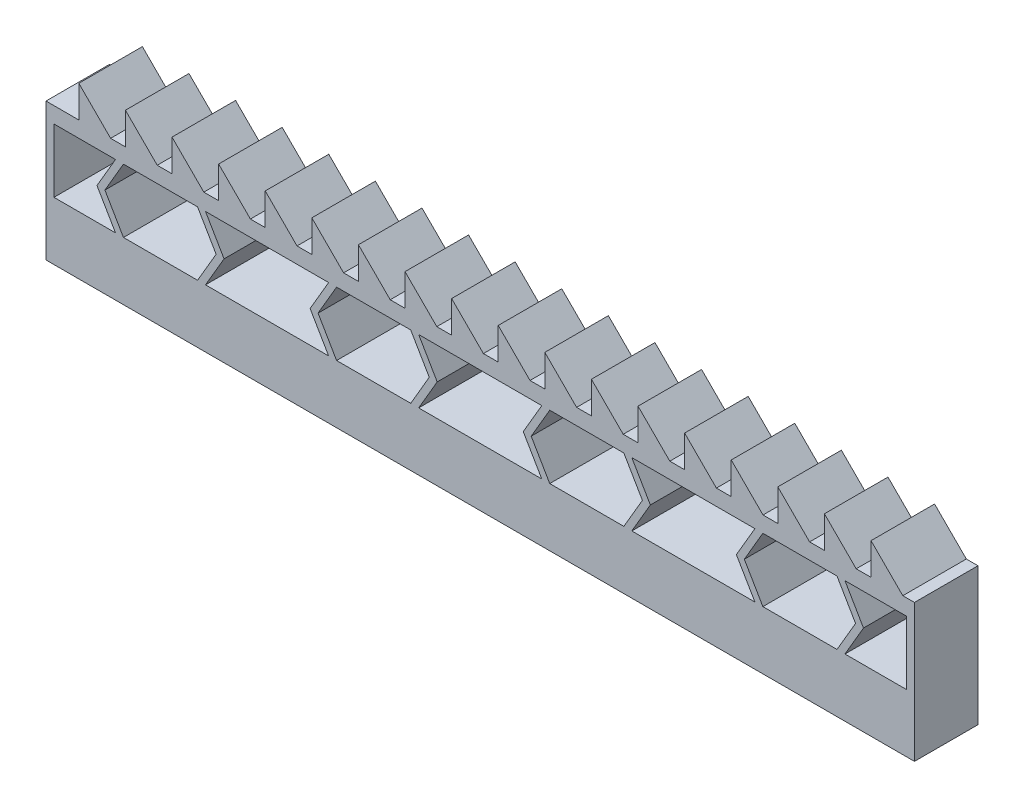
from build123d import *

# Parameters (mm, degrees)
SKETCH1_W           = 82
SKETCH1_H           = 6
BOSS_EXTRUDE1_DEPTH = 13
CUT_EXTRUDE1_DEPTH  = 84.240615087
SKETCH4_W           = 1.4
SKETCH4_H           = 4.8
BOSS_EXTRUDE2_DEPTH = 1.9
SKETCH5_W           = 2.9
SKETCH5_H           = 2
BOSS_EXTRUDE3_DEPTH = 2.1
BOSS_EXTRUDE5_DEPTH = 6
LPATTERN2_COUNT     = 18
LPATTERN2_PITCH     = 4.4
CUT_EXTRUDE2_DEPTH  = 6
LPATTERN3_COUNT     = 4
LPATTERN3_PITCH     = 20.125
FILLET1_R           = 0.5


with BuildPart() as part:
    # Sketch1 → Boss-Extrude1 (new body)
    with BuildSketch(Plane(origin=(0, 0, 0), x_dir=(1, 0, 0), z_dir=(0, 1, 0))):
        with Locations((41, 3)):
            Rectangle(SKETCH1_W, SKETCH1_H)
    extrude(amount=BOSS_EXTRUDE1_DEPTH)

    # Sketch3 → Cut-Extrude1 (cut, through all)
    with BuildSketch(Plane.ZY):
        Polygon((-4, 0), (-2, 0), (-2, 1.8), (-0.6, 1.8), (-0.6, 3.7), (-5.4, 3.7), (-5.4, 1.8), (-4, 1.8), align=None)
    extrude(amount=-CUT_EXTRUDE1_DEPTH, mode=Mode.SUBTRACT)

    # Sketch4 → Boss-Extrude2 (add)
    with BuildSketch(Plane.XZ.offset(-3.7)):
        with Locations((0.7, -3)):
            Rectangle(SKETCH4_W, SKETCH4_H)
        with Locations((81.3, -3)):
            Rectangle(SKETCH4_W, SKETCH4_H)
    extrude(amount=BOSS_EXTRUDE2_DEPTH)

    # Sketch5 → Boss-Extrude3 (add)
    with BuildSketch(Plane.XZ):
        with Locations((80.55, -3)):
            Rectangle(SKETCH5_W, SKETCH5_H)
        with Locations((1.45, -3)):
            Rectangle(SKETCH5_W, SKETCH5_H)
    extrude(amount=-BOSS_EXTRUDE3_DEPTH)

    # Sketch7 → Boss-Extrude5 (add)
    with BuildSketch(Plane.XY):
        Polygon((3.1, 13), (3.1, 16), (6.1, 13), align=None)
    boss_extrude5 = extrude(amount=-BOSS_EXTRUDE5_DEPTH)

    # LPattern2: Boss-Extrude5 ×18
    with Locations(*[(i * LPATTERN2_PITCH, 0, 0) for i in range(1, LPATTERN2_COUNT)]):
        add(boss_extrude5)

    # Sketch6 → Cut-Extrude2 (cut)
    with BuildSketch(Plane.XY):
        Polygon((6.5625, 5.5), (4.8125, 8.5), (6.5625, 11.5), (0.75, 11.5), (0.75, 5.5), align=None)
        Polygon((16.0625, 8.5), (14.3125, 11.5), (7.3125, 11.5), (5.5625, 8.5), (7.3125, 5.5), (14.3125, 5.5), align=None)
        Polygon((20.875, 11.5), (20.875, 5.5), (15.0625, 5.5), (16.8125, 8.5), (15.0625, 11.5), align=None)
    cut_extrude2 = extrude(amount=-CUT_EXTRUDE2_DEPTH, mode=Mode.SUBTRACT)

    # LPattern3: Cut-Extrude2 ×4
    with Locations(*[(i * LPATTERN3_PITCH, 0, 0) for i in range(1, LPATTERN3_COUNT)]):
        add(cut_extrude2, mode=Mode.SUBTRACT)

    # Fillet1
    fillet1_edges = [part.edges().sort_by_distance(p)[0] for p in [
        (2.9, 0, -3),
        (41, 0, -4),
        (41, 0, -2),
        (79.1, 0, -3),
    ]]
    fillet(fillet1_edges, radius=FILLET1_R)


solid = part.part
